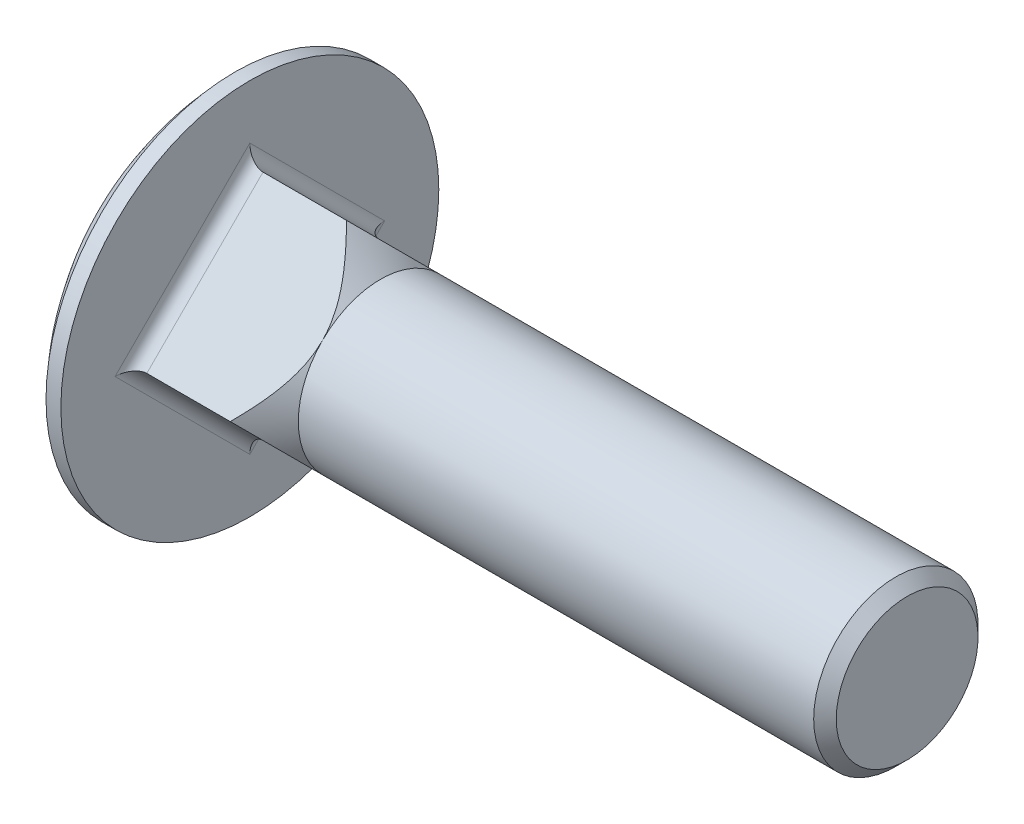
from build123d import *

# Parameters (mm, degrees)
BOSS_EXTRUDE1_DEPTH = 15.9
FILLET1_R           = 1.6


with BuildPart() as part:
    # BodySke → Base-Revolve (revolve)
    with BuildSketch(Plane.XY, mode=Mode.PRIVATE) as base_revolve_sk:
        with BuildLine():
            Line((9.0906, 23), (10.9, 23))
            Line((10.9, 23), (10.9, 10))
            Line((10.9, 10), (89.526, 10))
            Line((89.526, 10), (90.9, 8.626))
            Line((90.9, 8.626), (90.9, 0))
            Line((90.9, 0), (0, 0))
            ThreePointArc((0, 0), (2.355084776, 12.365668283), (9.0906, 23))
        make_face()
    revolve(base_revolve_sk.sketch.rotate(Axis((-31.75, 0, 0), (1, 0, 0)), 90), axis=Axis((-31.75, 0, 0), (1, 0, 0)))

    # Sketch1 → Boss-Extrude1 (add)
    with BuildSketch(Plane(origin=(10.9, 0, 0), x_dir=(0, 0, -1), z_dir=(1, 0, 0))):
        Polygon((0, 14.142135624), (14.142135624, 0), (0, -14.142135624), (-14.142135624, 0), align=None)
    extrude(amount=BOSS_EXTRUDE1_DEPTH)

    # Sketch2 → Cut-Revolve1 (revolve, cut)
    with BuildSketch(Plane.XY):
        Polygon((26.8, 10), (31.8, 10), (31.8, 24), (12.8, 24), align=None)
    revolve(axis=Axis((0, 0, 0), (1, 0, 0)), mode=Mode.SUBTRACT)

    # Fillet1
    fillet1_edges = [part.edges().sort_by_distance(p)[0] for p in [
        (10.9, 7.071067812, -7.071067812),
        (10.9, -7.071067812, -7.071067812),
        (10.9, 7.071067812, 7.071067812),
        (10.9, -7.071067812, 7.071067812),
    ]]
    fillet(fillet1_edges, radius=FILLET1_R)


solid = part.part
